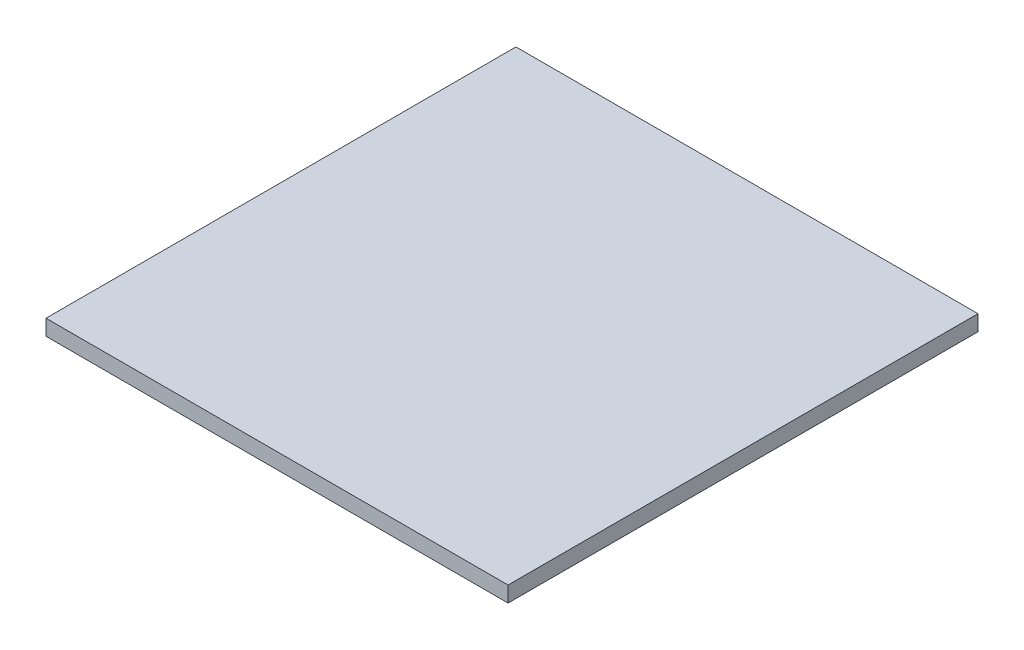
from build123d import *

# Parameters (mm, degrees)
SKETCH1_W           = 29.5
SKETCH1_H           = 30
BOSS_EXTRUDE1_DEPTH = 0.5


with BuildPart() as part:
    # Sketch1 → Boss-Extrude1 (new, symmetric)
    with BuildSketch(Plane(origin=(0, 0, 0), x_dir=(1, 0, 0), z_dir=(0, 1, 0))):
        Rectangle(SKETCH1_W, SKETCH1_H)
    extrude(amount=BOSS_EXTRUDE1_DEPTH, both=True)


solid = part.part
